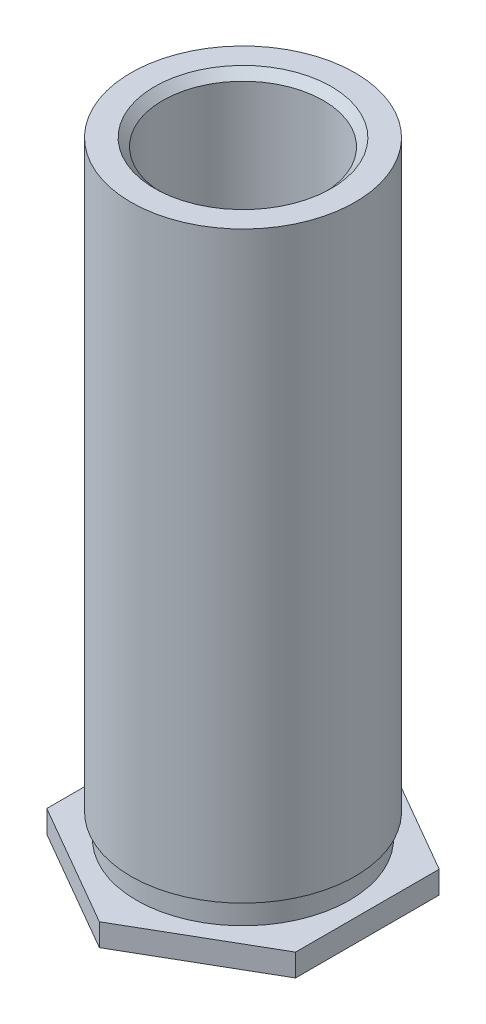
ISO-10303-21;
HEADER;
FILE_DESCRIPTION(('STEP AP214'),'2;1');
FILE_NAME('part.step','',(''),(''),'','','');
FILE_SCHEMA(('AUTOMOTIVE_DESIGN { 1 0 10303 214 1 1 1 1 }'));
ENDSEC;
DATA;
#1=APPLICATION_CONTEXT('core data for automotive mechanical design processes');
#2=APPLICATION_PROTOCOL_DEFINITION('international standard','automotive_design',2000,#1);
#3=PRODUCT_CONTEXT('',#1,'mechanical');
#4=PRODUCT('Part','Part','',(#3));
#5=PRODUCT_RELATED_PRODUCT_CATEGORY('part','',(#4));
#6=PRODUCT_DEFINITION_FORMATION('','',#4);
#7=PRODUCT_DEFINITION_CONTEXT('part definition',#1,'design');
#8=PRODUCT_DEFINITION('design','',#6,#7);
#9=PRODUCT_DEFINITION_SHAPE('','',#8);
#10=(LENGTH_UNIT() NAMED_UNIT(*) SI_UNIT(.MILLI.,.METRE.));
#11=(NAMED_UNIT(*) PLANE_ANGLE_UNIT() SI_UNIT($,.RADIAN.));
#12=(NAMED_UNIT(*) SI_UNIT($,.STERADIAN.) SOLID_ANGLE_UNIT());
#13=UNCERTAINTY_MEASURE_WITH_UNIT(LENGTH_MEASURE(1.E-05),#10,'distance_accuracy_value','');
#14=(GEOMETRIC_REPRESENTATION_CONTEXT(3) GLOBAL_UNCERTAINTY_ASSIGNED_CONTEXT((#13)) GLOBAL_UNIT_ASSIGNED_CONTEXT((#10,
#11,#12)) REPRESENTATION_CONTEXT('',''));
#15=CARTESIAN_POINT('',(0.,0.,0.));
#16=DIRECTION('',(0.,0.,1.));
#17=DIRECTION('',(1.,0.,0.));
#18=AXIS2_PLACEMENT_3D('',#15,#16,#17);
#19=CARTESIAN_POINT('',(4.582,0.712,0.));
#20=DIRECTION('',(0.,1.,0.));
#21=DIRECTION('',(0.,0.,1.));
#22=AXIS2_PLACEMENT_3D('',#19,#20,#21);
#23=PLANE('',#22);
#24=CARTESIAN_POINT('',(0.,0.712,0.));
#25=DIRECTION('',(0.,-1.,0.));
#26=DIRECTION('',(0.,0.,-1.));
#27=AXIS2_PLACEMENT_3D('',#24,#25,#26);
#28=CIRCLE('',#27,3.382);
#29=CARTESIAN_POINT('',(0.,0.712,-3.382));
#30=VERTEX_POINT('',#29);
#31=EDGE_CURVE('E147',#30,#30,#28,.T.);
#32=ORIENTED_EDGE('',*,*,#31,.T.);
#33=EDGE_LOOP('',(#32));
#34=FACE_BOUND('',#33,.T.);
#35=DIRECTION('',(0.866025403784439,0.,0.5));
#36=VECTOR('',#35,1.);
#37=CARTESIAN_POINT('',(0.,0.712,4.56106712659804));
#38=LINE('',#37,#36);
#39=CARTESIAN_POINT('',(-3.95,0.712,2.28053356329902));
#40=VERTEX_POINT('',#39);
#41=CARTESIAN_POINT('',(0.,0.712,4.56106712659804));
#42=VERTEX_POINT('',#41);
#43=EDGE_CURVE('E134',#40,#42,#38,.T.);
#44=ORIENTED_EDGE('',*,*,#43,.T.);
#45=DIRECTION('',(0.866025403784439,0.,-0.5));
#46=VECTOR('',#45,1.);
#47=CARTESIAN_POINT('',(3.95,0.712,2.28053356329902));
#48=LINE('',#47,#46);
#49=CARTESIAN_POINT('',(3.95,0.712,2.28053356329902));
#50=VERTEX_POINT('',#49);
#51=EDGE_CURVE('E124',#42,#50,#48,.T.);
#52=ORIENTED_EDGE('',*,*,#51,.T.);
#53=DIRECTION('',(0.,0.,-1.));
#54=VECTOR('',#53,1.);
#55=CARTESIAN_POINT('',(3.95,0.712,-2.28053356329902));
#56=LINE('',#55,#54);
#57=CARTESIAN_POINT('',(3.95,0.712,-2.28053356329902));
#58=VERTEX_POINT('',#57);
#59=EDGE_CURVE('E129',#50,#58,#56,.T.);
#60=ORIENTED_EDGE('',*,*,#59,.T.);
#61=DIRECTION('',(-0.866025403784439,0.,-0.5));
#62=VECTOR('',#61,1.);
#63=CARTESIAN_POINT('',(0.,0.712,-4.56106712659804));
#64=LINE('',#63,#62);
#65=CARTESIAN_POINT('',(0.,0.712,-4.56106712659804));
#66=VERTEX_POINT('',#65);
#67=EDGE_CURVE('E53',#58,#66,#64,.T.);
#68=ORIENTED_EDGE('',*,*,#67,.T.);
#69=DIRECTION('',(-0.866025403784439,0.,0.5));
#70=VECTOR('',#69,1.);
#71=CARTESIAN_POINT('',(-3.95,0.712,-2.28053356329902));
#72=LINE('',#71,#70);
#73=CARTESIAN_POINT('',(-3.95,0.712,-2.28053356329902));
#74=VERTEX_POINT('',#73);
#75=EDGE_CURVE('E100',#66,#74,#72,.T.);
#76=ORIENTED_EDGE('',*,*,#75,.T.);
#77=DIRECTION('',(0.,0.,1.));
#78=VECTOR('',#77,1.);
#79=CARTESIAN_POINT('',(-3.95,0.712,2.28053356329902));
#80=LINE('',#79,#78);
#81=EDGE_CURVE('E132',#74,#40,#80,.T.);
#82=ORIENTED_EDGE('',*,*,#81,.T.);
#83=EDGE_LOOP('',(#44,#52,#60,#68,#76,#82));
#84=FACE_BOUND('',#83,.T.);
#85=ADVANCED_FACE('F39',(#34,#84),#23,.T.);
#86=CARTESIAN_POINT('',(3.56,0.,0.));
#87=DIRECTION('',(0.,-1.,0.));
#88=DIRECTION('',(0.,0.,-1.));
#89=AXIS2_PLACEMENT_3D('',#86,#87,#88);
#90=PLANE('',#89);
#91=CARTESIAN_POINT('',(0.,0.,0.));
#92=DIRECTION('',(0.,-1.,0.));
#93=DIRECTION('',(0.,0.,-1.));
#94=AXIS2_PLACEMENT_3D('',#91,#92,#93);
#95=CIRCLE('',#94,3.56);
#96=CARTESIAN_POINT('',(0.,0.,-3.56));
#97=VERTEX_POINT('',#96);
#98=EDGE_CURVE('E146',#97,#97,#95,.T.);
#99=ORIENTED_EDGE('',*,*,#98,.F.);
#100=EDGE_LOOP('',(#99));
#101=FACE_BOUND('',#100,.T.);
#102=DIRECTION('',(0.,0.,-1.));
#103=VECTOR('',#102,1.);
#104=CARTESIAN_POINT('',(3.95,0.,-2.28053356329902));
#105=LINE('',#104,#103);
#106=CARTESIAN_POINT('',(3.95,0.,2.28053356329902));
#107=VERTEX_POINT('',#106);
#108=CARTESIAN_POINT('',(3.95,0.,-2.28053356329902));
#109=VERTEX_POINT('',#108);
#110=EDGE_CURVE('E107',#107,#109,#105,.T.);
#111=ORIENTED_EDGE('',*,*,#110,.F.);
#112=DIRECTION('',(0.866025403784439,0.,-0.5));
#113=VECTOR('',#112,1.);
#114=CARTESIAN_POINT('',(3.95,0.,2.28053356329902));
#115=LINE('',#114,#113);
#116=CARTESIAN_POINT('',(0.,0.,4.56106712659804));
#117=VERTEX_POINT('',#116);
#118=EDGE_CURVE('E61',#117,#107,#115,.T.);
#119=ORIENTED_EDGE('',*,*,#118,.F.);
#120=DIRECTION('',(0.866025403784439,0.,0.5));
#121=VECTOR('',#120,1.);
#122=CARTESIAN_POINT('',(0.,0.,4.56106712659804));
#123=LINE('',#122,#121);
#124=CARTESIAN_POINT('',(-3.95,0.,2.28053356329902));
#125=VERTEX_POINT('',#124);
#126=EDGE_CURVE('E116',#125,#117,#123,.T.);
#127=ORIENTED_EDGE('',*,*,#126,.F.);
#128=DIRECTION('',(0.,0.,1.));
#129=VECTOR('',#128,1.);
#130=CARTESIAN_POINT('',(-3.95,0.,2.28053356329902));
#131=LINE('',#130,#129);
#132=CARTESIAN_POINT('',(-3.95,0.,-2.28053356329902));
#133=VERTEX_POINT('',#132);
#134=EDGE_CURVE('E112',#133,#125,#131,.T.);
#135=ORIENTED_EDGE('',*,*,#134,.F.);
#136=DIRECTION('',(-0.866025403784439,0.,0.5));
#137=VECTOR('',#136,1.);
#138=CARTESIAN_POINT('',(-3.95,0.,-2.28053356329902));
#139=LINE('',#138,#137);
#140=CARTESIAN_POINT('',(0.,0.,-4.56106712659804));
#141=VERTEX_POINT('',#140);
#142=EDGE_CURVE('E98',#141,#133,#139,.T.);
#143=ORIENTED_EDGE('',*,*,#142,.F.);
#144=DIRECTION('',(-0.866025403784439,0.,-0.5));
#145=VECTOR('',#144,1.);
#146=CARTESIAN_POINT('',(0.,0.,-4.56106712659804));
#147=LINE('',#146,#145);
#148=EDGE_CURVE('E104',#109,#141,#147,.T.);
#149=ORIENTED_EDGE('',*,*,#148,.F.);
#150=EDGE_LOOP('',(#111,#119,#127,#135,#143,#149));
#151=FACE_BOUND('',#150,.T.);
#152=ADVANCED_FACE('F111',(#101,#151),#90,.T.);
#153=CARTESIAN_POINT('',(2.805,0.00507999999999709,0.));
#154=DIRECTION('',(0.,-1.,0.));
#155=DIRECTION('',(0.,0.,-1.));
#156=AXIS2_PLACEMENT_3D('',#153,#154,#155);
#157=PLANE('',#156);
#158=CARTESIAN_POINT('',(0.,0.00507999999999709,0.));
#159=DIRECTION('',(0.,-1.,0.));
#160=DIRECTION('',(0.,0.,-1.));
#161=AXIS2_PLACEMENT_3D('',#158,#159,#160);
#162=CIRCLE('',#161,3.56);
#163=CARTESIAN_POINT('',(0.,0.00507999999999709,-3.56));
#164=VERTEX_POINT('',#163);
#165=EDGE_CURVE('E136',#164,#164,#162,.T.);
#166=ORIENTED_EDGE('',*,*,#165,.T.);
#167=EDGE_LOOP('',(#166));
#168=FACE_BOUND('',#167,.T.);
#169=CARTESIAN_POINT('',(0.,0.00507999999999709,0.));
#170=DIRECTION('',(0.,-1.,0.));
#171=DIRECTION('',(0.,0.,-1.));
#172=AXIS2_PLACEMENT_3D('',#169,#170,#171);
#173=CIRCLE('',#172,2.805);
#174=CARTESIAN_POINT('',(0.,0.00507999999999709,-2.805));
#175=VERTEX_POINT('',#174);
#176=EDGE_CURVE('E11',#175,#175,#173,.T.);
#177=ORIENTED_EDGE('',*,*,#176,.F.);
#178=EDGE_LOOP('',(#177));
#179=FACE_BOUND('',#178,.T.);
#180=ADVANCED_FACE('F41',(#168,#179),#157,.T.);
#181=CARTESIAN_POINT('',(0.,0.26008,0.));
#182=DIRECTION('',(0.,-1.,0.));
#183=DIRECTION('',(0.,0.,-1.));
#184=AXIS2_PLACEMENT_3D('',#181,#182,#183);
#185=CONICAL_SURFACE('',#184,2.55,0.785398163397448);
#186=ORIENTED_EDGE('',*,*,#176,.T.);
#187=EDGE_LOOP('',(#186));
#188=FACE_BOUND('',#187,.T.);
#189=CARTESIAN_POINT('',(0.,0.26008,0.));
#190=DIRECTION('',(0.,-1.,0.));
#191=DIRECTION('',(0.,0.,-1.));
#192=AXIS2_PLACEMENT_3D('',#189,#190,#191);
#193=CIRCLE('',#192,2.55);
#194=CARTESIAN_POINT('',(0.,0.26008,-2.55));
#195=VERTEX_POINT('',#194);
#196=EDGE_CURVE('E50',#195,#195,#193,.T.);
#197=ORIENTED_EDGE('',*,*,#196,.F.);
#198=EDGE_LOOP('',(#197));
#199=FACE_BOUND('',#198,.T.);
#200=ADVANCED_FACE('F173',(#188,#199),#185,.F.);
#201=CARTESIAN_POINT('',(0.,0.,0.));
#202=DIRECTION('',(0.,-1.,0.));
#203=DIRECTION('',(0.,0.,-1.));
#204=AXIS2_PLACEMENT_3D('',#201,#202,#203);
#205=CYLINDRICAL_SURFACE('',#204,2.55);
#206=ORIENTED_EDGE('',*,*,#196,.T.);
#207=EDGE_LOOP('',(#206));
#208=FACE_BOUND('',#207,.T.);
#209=CARTESIAN_POINT('',(0.,19.745,0.));
#210=DIRECTION('',(0.,-1.,0.));
#211=DIRECTION('',(0.,0.,-1.));
#212=AXIS2_PLACEMENT_3D('',#209,#210,#211);
#213=CIRCLE('',#212,2.55);
#214=CARTESIAN_POINT('',(0.,19.745,-2.55));
#215=VERTEX_POINT('',#214);
#216=EDGE_CURVE('E164',#215,#215,#213,.T.);
#217=ORIENTED_EDGE('',*,*,#216,.F.);
#218=EDGE_LOOP('',(#217));
#219=FACE_BOUND('',#218,.T.);
#220=ADVANCED_FACE('F167',(#208,#219),#205,.F.);
#221=CARTESIAN_POINT('',(0.,20.,0.));
#222=DIRECTION('',(0.,1.,0.));
#223=DIRECTION('',(0.,0.,1.));
#224=AXIS2_PLACEMENT_3D('',#221,#222,#223);
#225=CONICAL_SURFACE('',#224,2.805,0.78539816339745);
#226=ORIENTED_EDGE('',*,*,#216,.T.);
#227=EDGE_LOOP('',(#226));
#228=FACE_BOUND('',#227,.T.);
#229=CARTESIAN_POINT('',(0.,20.,0.));
#230=DIRECTION('',(0.,-1.,0.));
#231=DIRECTION('',(0.,0.,-1.));
#232=AXIS2_PLACEMENT_3D('',#229,#230,#231);
#233=CIRCLE('',#232,2.805);
#234=CARTESIAN_POINT('',(0.,20.,-2.805));
#235=VERTEX_POINT('',#234);
#236=EDGE_CURVE('E162',#235,#235,#233,.T.);
#237=ORIENTED_EDGE('',*,*,#236,.F.);
#238=EDGE_LOOP('',(#237));
#239=FACE_BOUND('',#238,.T.);
#240=ADVANCED_FACE('F179',(#228,#239),#225,.F.);
#241=CARTESIAN_POINT('',(3.56,20.,0.));
#242=DIRECTION('',(0.,1.,0.));
#243=DIRECTION('',(0.,0.,1.));
#244=AXIS2_PLACEMENT_3D('',#241,#242,#243);
#245=PLANE('',#244);
#246=ORIENTED_EDGE('',*,*,#236,.T.);
#247=EDGE_LOOP('',(#246));
#248=FACE_BOUND('',#247,.T.);
#249=CARTESIAN_POINT('',(0.,20.,0.));
#250=DIRECTION('',(0.,-1.,0.));
#251=DIRECTION('',(0.,0.,-1.));
#252=AXIS2_PLACEMENT_3D('',#249,#250,#251);
#253=CIRCLE('',#252,3.56);
#254=CARTESIAN_POINT('',(0.,20.,-3.56));
#255=VERTEX_POINT('',#254);
#256=EDGE_CURVE('E156',#255,#255,#253,.T.);
#257=ORIENTED_EDGE('',*,*,#256,.F.);
#258=EDGE_LOOP('',(#257));
#259=FACE_BOUND('',#258,.T.);
#260=ADVANCED_FACE('F210',(#248,#259),#245,.T.);
#261=CARTESIAN_POINT('',(0.,0.,0.));
#262=DIRECTION('',(0.,-1.,0.));
#263=DIRECTION('',(0.,0.,-1.));
#264=AXIS2_PLACEMENT_3D('',#261,#262,#263);
#265=CYLINDRICAL_SURFACE('',#264,3.56);
#266=ORIENTED_EDGE('',*,*,#256,.T.);
#267=EDGE_LOOP('',(#266));
#268=FACE_BOUND('',#267,.T.);
#269=CARTESIAN_POINT('',(0.,1.4596,0.));
#270=DIRECTION('',(0.,-1.,0.));
#271=DIRECTION('',(0.,0.,-1.));
#272=AXIS2_PLACEMENT_3D('',#269,#270,#271);
#273=CIRCLE('',#272,3.56);
#274=CARTESIAN_POINT('',(0.,1.4596,-3.56));
#275=VERTEX_POINT('',#274);
#276=EDGE_CURVE('E157',#275,#275,#273,.T.);
#277=ORIENTED_EDGE('',*,*,#276,.F.);
#278=EDGE_LOOP('',(#277));
#279=FACE_BOUND('',#278,.T.);
#280=ADVANCED_FACE('F204',(#268,#279),#265,.T.);
#281=CARTESIAN_POINT('',(3.56,1.4596,0.));
#282=DIRECTION('',(0.,-1.,0.));
#283=DIRECTION('',(0.,0.,-1.));
#284=AXIS2_PLACEMENT_3D('',#281,#282,#283);
#285=PLANE('',#284);
#286=ORIENTED_EDGE('',*,*,#276,.T.);
#287=EDGE_LOOP('',(#286));
#288=FACE_BOUND('',#287,.T.);
#289=CARTESIAN_POINT('',(0.,1.4596,0.));
#290=DIRECTION('',(0.,-1.,0.));
#291=DIRECTION('',(0.,0.,-1.));
#292=AXIS2_PLACEMENT_3D('',#289,#290,#291);
#293=CIRCLE('',#292,3.382);
#294=CARTESIAN_POINT('',(0.,1.4596,-3.382));
#295=VERTEX_POINT('',#294);
#296=EDGE_CURVE('E153',#295,#295,#293,.T.);
#297=ORIENTED_EDGE('',*,*,#296,.F.);
#298=EDGE_LOOP('',(#297));
#299=FACE_BOUND('',#298,.T.);
#300=ADVANCED_FACE('F199',(#288,#299),#285,.T.);
#301=CARTESIAN_POINT('',(0.,0.,0.));
#302=DIRECTION('',(0.,-1.,0.));
#303=DIRECTION('',(0.,0.,-1.));
#304=AXIS2_PLACEMENT_3D('',#301,#302,#303);
#305=CYLINDRICAL_SURFACE('',#304,3.382);
#306=ORIENTED_EDGE('',*,*,#296,.T.);
#307=EDGE_LOOP('',(#306));
#308=FACE_BOUND('',#307,.T.);
#309=ORIENTED_EDGE('',*,*,#31,.F.);
#310=EDGE_LOOP('',(#309));
#311=FACE_BOUND('',#310,.T.);
#312=ADVANCED_FACE('F192',(#308,#311),#305,.T.);
#313=CARTESIAN_POINT('',(0.,0.,0.));
#314=DIRECTION('',(0.,-1.,0.));
#315=DIRECTION('',(0.,0.,-1.));
#316=AXIS2_PLACEMENT_3D('',#313,#314,#315);
#317=CYLINDRICAL_SURFACE('',#316,3.56);
#318=ORIENTED_EDGE('',*,*,#98,.T.);
#319=EDGE_LOOP('',(#318));
#320=FACE_BOUND('',#319,.T.);
#321=ORIENTED_EDGE('',*,*,#165,.F.);
#322=EDGE_LOOP('',(#321));
#323=FACE_BOUND('',#322,.T.);
#324=ADVANCED_FACE('F198',(#320,#323),#317,.F.);
#325=CARTESIAN_POINT('',(3.95,0.,2.28053356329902));
#326=DIRECTION('',(0.5,0.,0.866025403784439));
#327=DIRECTION('',(0.866025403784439,0.,-0.5));
#328=AXIS2_PLACEMENT_3D('',#325,#326,#327);
#329=PLANE('',#328);
#330=ORIENTED_EDGE('',*,*,#51,.F.);
#331=DIRECTION('',(0.,1.,0.));
#332=VECTOR('',#331,1.);
#333=CARTESIAN_POINT('',(0.,0.,4.56106712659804));
#334=LINE('',#333,#332);
#335=EDGE_CURVE('E140',#117,#42,#334,.T.);
#336=ORIENTED_EDGE('',*,*,#335,.F.);
#337=ORIENTED_EDGE('',*,*,#118,.T.);
#338=DIRECTION('',(0.,1.,0.));
#339=VECTOR('',#338,1.);
#340=CARTESIAN_POINT('',(3.95,0.,2.28053356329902));
#341=LINE('',#340,#339);
#342=EDGE_CURVE('E125',#107,#50,#341,.T.);
#343=ORIENTED_EDGE('',*,*,#342,.T.);
#344=EDGE_LOOP('',(#330,#336,#337,#343));
#345=FACE_BOUND('',#344,.T.);
#346=ADVANCED_FACE('F251',(#345),#329,.T.);
#347=CARTESIAN_POINT('',(0.,0.,4.56106712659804));
#348=DIRECTION('',(-0.5,0.,0.866025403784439));
#349=DIRECTION('',(0.866025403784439,0.,0.5));
#350=AXIS2_PLACEMENT_3D('',#347,#348,#349);
#351=PLANE('',#350);
#352=ORIENTED_EDGE('',*,*,#43,.F.);
#353=DIRECTION('',(0.,1.,0.));
#354=VECTOR('',#353,1.);
#355=CARTESIAN_POINT('',(-3.95,0.,2.28053356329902));
#356=LINE('',#355,#354);
#357=EDGE_CURVE('E138',#125,#40,#356,.T.);
#358=ORIENTED_EDGE('',*,*,#357,.F.);
#359=ORIENTED_EDGE('',*,*,#126,.T.);
#360=ORIENTED_EDGE('',*,*,#335,.T.);
#361=EDGE_LOOP('',(#352,#358,#359,#360));
#362=FACE_BOUND('',#361,.T.);
#363=ADVANCED_FACE('F273',(#362),#351,.T.);
#364=CARTESIAN_POINT('',(-3.95,0.,2.28053356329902));
#365=DIRECTION('',(-1.,0.,0.));
#366=DIRECTION('',(0.,0.,1.));
#367=AXIS2_PLACEMENT_3D('',#364,#365,#366);
#368=PLANE('',#367);
#369=ORIENTED_EDGE('',*,*,#81,.F.);
#370=DIRECTION('',(0.,1.,0.));
#371=VECTOR('',#370,1.);
#372=CARTESIAN_POINT('',(-3.95,0.,-2.28053356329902));
#373=LINE('',#372,#371);
#374=EDGE_CURVE('E99',#133,#74,#373,.T.);
#375=ORIENTED_EDGE('',*,*,#374,.F.);
#376=ORIENTED_EDGE('',*,*,#134,.T.);
#377=ORIENTED_EDGE('',*,*,#357,.T.);
#378=EDGE_LOOP('',(#369,#375,#376,#377));
#379=FACE_BOUND('',#378,.T.);
#380=ADVANCED_FACE('F284',(#379),#368,.T.);
#381=CARTESIAN_POINT('',(-3.95,0.,-2.28053356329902));
#382=DIRECTION('',(-0.5,0.,-0.866025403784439));
#383=DIRECTION('',(-0.866025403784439,0.,0.5));
#384=AXIS2_PLACEMENT_3D('',#381,#382,#383);
#385=PLANE('',#384);
#386=ORIENTED_EDGE('',*,*,#75,.F.);
#387=DIRECTION('',(0.,1.,0.));
#388=VECTOR('',#387,1.);
#389=CARTESIAN_POINT('',(0.,0.,-4.56106712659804));
#390=LINE('',#389,#388);
#391=EDGE_CURVE('E95',#141,#66,#390,.T.);
#392=ORIENTED_EDGE('',*,*,#391,.F.);
#393=ORIENTED_EDGE('',*,*,#142,.T.);
#394=ORIENTED_EDGE('',*,*,#374,.T.);
#395=EDGE_LOOP('',(#386,#392,#393,#394));
#396=FACE_BOUND('',#395,.T.);
#397=ADVANCED_FACE('F91',(#396),#385,.T.);
#398=CARTESIAN_POINT('',(0.,0.,-4.56106712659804));
#399=DIRECTION('',(0.5,0.,-0.866025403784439));
#400=DIRECTION('',(-0.866025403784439,0.,-0.5));
#401=AXIS2_PLACEMENT_3D('',#398,#399,#400);
#402=PLANE('',#401);
#403=ORIENTED_EDGE('',*,*,#67,.F.);
#404=DIRECTION('',(0.,1.,0.));
#405=VECTOR('',#404,1.);
#406=CARTESIAN_POINT('',(3.95,0.,-2.28053356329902));
#407=LINE('',#406,#405);
#408=EDGE_CURVE('E103',#109,#58,#407,.T.);
#409=ORIENTED_EDGE('',*,*,#408,.F.);
#410=ORIENTED_EDGE('',*,*,#148,.T.);
#411=ORIENTED_EDGE('',*,*,#391,.T.);
#412=EDGE_LOOP('',(#403,#409,#410,#411));
#413=FACE_BOUND('',#412,.T.);
#414=ADVANCED_FACE('F102',(#413),#402,.T.);
#415=CARTESIAN_POINT('',(3.95,0.,-2.28053356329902));
#416=DIRECTION('',(1.,0.,0.));
#417=DIRECTION('',(0.,0.,-1.));
#418=AXIS2_PLACEMENT_3D('',#415,#416,#417);
#419=PLANE('',#418);
#420=ORIENTED_EDGE('',*,*,#59,.F.);
#421=ORIENTED_EDGE('',*,*,#342,.F.);
#422=ORIENTED_EDGE('',*,*,#110,.T.);
#423=ORIENTED_EDGE('',*,*,#408,.T.);
#424=EDGE_LOOP('',(#420,#421,#422,#423));
#425=FACE_BOUND('',#424,.T.);
#426=ADVANCED_FACE('F311',(#425),#419,.T.);
#427=CLOSED_SHELL('',(#85,#152,#180,#200,#220,#240,#260,#280,#300,#312,#324,#346,#363,#380,#397,
#414,#426));
#428=MANIFOLD_SOLID_BREP('B2',#427);
#429=ADVANCED_BREP_SHAPE_REPRESENTATION('',(#18,#428),#14);
#430=SHAPE_DEFINITION_REPRESENTATION(#9,#429);
ENDSEC;
END-ISO-10303-21;
